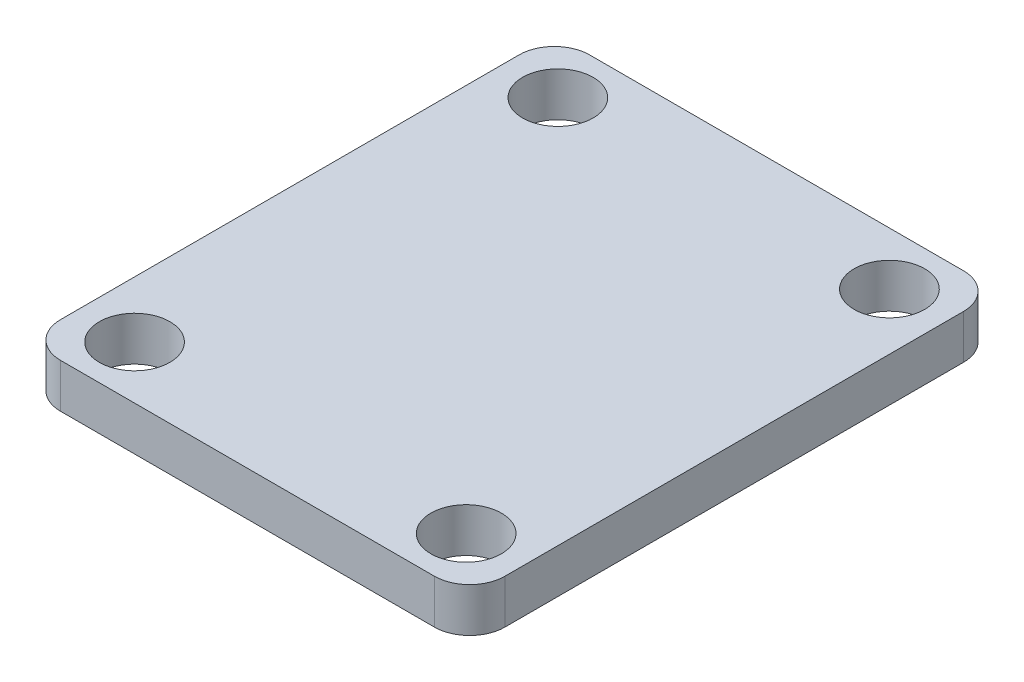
ISO-10303-21;
HEADER;
FILE_DESCRIPTION(('STEP AP214'),'2;1');
FILE_NAME('part.step','',(''),(''),'','','');
FILE_SCHEMA(('AUTOMOTIVE_DESIGN { 1 0 10303 214 1 1 1 1 }'));
ENDSEC;
DATA;
#1=APPLICATION_CONTEXT('core data for automotive mechanical design processes');
#2=APPLICATION_PROTOCOL_DEFINITION('international standard','automotive_design',2000,#1);
#3=PRODUCT_CONTEXT('',#1,'mechanical');
#4=PRODUCT('Part','Part','',(#3));
#5=PRODUCT_RELATED_PRODUCT_CATEGORY('part','',(#4));
#6=PRODUCT_DEFINITION_FORMATION('','',#4);
#7=PRODUCT_DEFINITION_CONTEXT('part definition',#1,'design');
#8=PRODUCT_DEFINITION('design','',#6,#7);
#9=PRODUCT_DEFINITION_SHAPE('','',#8);
#10=(LENGTH_UNIT() NAMED_UNIT(*) SI_UNIT(.MILLI.,.METRE.));
#11=(NAMED_UNIT(*) PLANE_ANGLE_UNIT() SI_UNIT($,.RADIAN.));
#12=(NAMED_UNIT(*) SI_UNIT($,.STERADIAN.) SOLID_ANGLE_UNIT());
#13=UNCERTAINTY_MEASURE_WITH_UNIT(LENGTH_MEASURE(1.E-05),#10,'distance_accuracy_value','');
#14=(GEOMETRIC_REPRESENTATION_CONTEXT(3) GLOBAL_UNCERTAINTY_ASSIGNED_CONTEXT((#13)) GLOBAL_UNIT_ASSIGNED_CONTEXT((#10,
#11,#12)) REPRESENTATION_CONTEXT('',''));
#15=CARTESIAN_POINT('',(0.,0.,0.));
#16=DIRECTION('',(0.,0.,1.));
#17=DIRECTION('',(1.,0.,0.));
#18=AXIS2_PLACEMENT_3D('',#15,#16,#17);
#19=CARTESIAN_POINT('',(-16.002,-3.175,19.05));
#20=DIRECTION('',(-1.,0.,0.));
#21=DIRECTION('',(0.,0.,1.));
#22=AXIS2_PLACEMENT_3D('',#19,#20,#21);
#23=PLANE('',#22);
#24=DIRECTION('',(0.,0.,1.));
#25=VECTOR('',#24,1.);
#26=CARTESIAN_POINT('',(-16.002,-3.175,19.05));
#27=LINE('',#26,#25);
#28=CARTESIAN_POINT('',(-16.002,-3.175,-16.51));
#29=VERTEX_POINT('',#28);
#30=CARTESIAN_POINT('',(-16.002,-3.175,16.51));
#31=VERTEX_POINT('',#30);
#32=EDGE_CURVE('E169',#29,#31,#27,.T.);
#33=ORIENTED_EDGE('',*,*,#32,.T.);
#34=DIRECTION('',(0.,1.,0.));
#35=VECTOR('',#34,1.);
#36=CARTESIAN_POINT('',(-16.002,-3.175,16.51));
#37=LINE('',#36,#35);
#38=CARTESIAN_POINT('',(-16.002,0.,16.51));
#39=VERTEX_POINT('',#38);
#40=EDGE_CURVE('E123',#31,#39,#37,.T.);
#41=ORIENTED_EDGE('',*,*,#40,.T.);
#42=DIRECTION('',(0.,0.,1.));
#43=VECTOR('',#42,1.);
#44=CARTESIAN_POINT('',(-16.002,0.,19.05));
#45=LINE('',#44,#43);
#46=CARTESIAN_POINT('',(-16.002,0.,-16.51));
#47=VERTEX_POINT('',#46);
#48=EDGE_CURVE('E107',#47,#39,#45,.T.);
#49=ORIENTED_EDGE('',*,*,#48,.F.);
#50=DIRECTION('',(0.,1.,0.));
#51=VECTOR('',#50,1.);
#52=CARTESIAN_POINT('',(-16.002,-3.175,-16.51));
#53=LINE('',#52,#51);
#54=EDGE_CURVE('E120',#47,#29,#53,.F.);
#55=ORIENTED_EDGE('',*,*,#54,.T.);
#56=EDGE_LOOP('',(#33,#41,#49,#55));
#57=FACE_BOUND('',#56,.T.);
#58=ADVANCED_FACE('F38',(#57),#23,.T.);
#59=CARTESIAN_POINT('',(16.002,-3.175,-19.05));
#60=DIRECTION('',(0.,0.,-1.));
#61=DIRECTION('',(-1.,0.,0.));
#62=AXIS2_PLACEMENT_3D('',#59,#60,#61);
#63=PLANE('',#62);
#64=DIRECTION('',(-1.,0.,0.));
#65=VECTOR('',#64,1.);
#66=CARTESIAN_POINT('',(16.002,-3.175,-19.05));
#67=LINE('',#66,#65);
#68=CARTESIAN_POINT('',(13.462,-3.175,-19.05));
#69=VERTEX_POINT('',#68);
#70=CARTESIAN_POINT('',(-13.462,-3.175,-19.05));
#71=VERTEX_POINT('',#70);
#72=EDGE_CURVE('E130',#69,#71,#67,.T.);
#73=ORIENTED_EDGE('',*,*,#72,.T.);
#74=DIRECTION('',(0.,1.,0.));
#75=VECTOR('',#74,1.);
#76=CARTESIAN_POINT('',(-13.462,-3.175,-19.05));
#77=LINE('',#76,#75);
#78=CARTESIAN_POINT('',(-13.462,0.,-19.05));
#79=VERTEX_POINT('',#78);
#80=EDGE_CURVE('E156',#71,#79,#77,.T.);
#81=ORIENTED_EDGE('',*,*,#80,.T.);
#82=DIRECTION('',(-1.,0.,0.));
#83=VECTOR('',#82,1.);
#84=CARTESIAN_POINT('',(16.002,0.,-19.05));
#85=LINE('',#84,#83);
#86=CARTESIAN_POINT('',(13.462,0.,-19.05));
#87=VERTEX_POINT('',#86);
#88=EDGE_CURVE('E109',#87,#79,#85,.T.);
#89=ORIENTED_EDGE('',*,*,#88,.F.);
#90=DIRECTION('',(0.,1.,0.));
#91=VECTOR('',#90,1.);
#92=CARTESIAN_POINT('',(13.462,-3.175,-19.05));
#93=LINE('',#92,#91);
#94=EDGE_CURVE('E154',#87,#69,#93,.F.);
#95=ORIENTED_EDGE('',*,*,#94,.T.);
#96=EDGE_LOOP('',(#73,#81,#89,#95));
#97=FACE_BOUND('',#96,.T.);
#98=ADVANCED_FACE('F158',(#97),#63,.T.);
#99=CARTESIAN_POINT('',(16.002,-3.175,19.05));
#100=DIRECTION('',(1.,0.,0.));
#101=DIRECTION('',(0.,0.,-1.));
#102=AXIS2_PLACEMENT_3D('',#99,#100,#101);
#103=PLANE('',#102);
#104=DIRECTION('',(0.,0.,-1.));
#105=VECTOR('',#104,1.);
#106=CARTESIAN_POINT('',(16.002,-3.175,19.05));
#107=LINE('',#106,#105);
#108=CARTESIAN_POINT('',(16.002,-3.175,16.51));
#109=VERTEX_POINT('',#108);
#110=CARTESIAN_POINT('',(16.002,-3.175,-16.51));
#111=VERTEX_POINT('',#110);
#112=EDGE_CURVE('E135',#109,#111,#107,.T.);
#113=ORIENTED_EDGE('',*,*,#112,.T.);
#114=DIRECTION('',(0.,1.,0.));
#115=VECTOR('',#114,1.);
#116=CARTESIAN_POINT('',(16.002,-3.175,-16.51));
#117=LINE('',#116,#115);
#118=CARTESIAN_POINT('',(16.002,0.,-16.51));
#119=VERTEX_POINT('',#118);
#120=EDGE_CURVE('E11',#111,#119,#117,.T.);
#121=ORIENTED_EDGE('',*,*,#120,.T.);
#122=DIRECTION('',(0.,0.,-1.));
#123=VECTOR('',#122,1.);
#124=CARTESIAN_POINT('',(16.002,0.,19.05));
#125=LINE('',#124,#123);
#126=CARTESIAN_POINT('',(16.002,0.,16.51));
#127=VERTEX_POINT('',#126);
#128=EDGE_CURVE('E167',#127,#119,#125,.T.);
#129=ORIENTED_EDGE('',*,*,#128,.F.);
#130=DIRECTION('',(0.,1.,0.));
#131=VECTOR('',#130,1.);
#132=CARTESIAN_POINT('',(16.002,-3.175,16.51));
#133=LINE('',#132,#131);
#134=EDGE_CURVE('E46',#127,#109,#133,.F.);
#135=ORIENTED_EDGE('',*,*,#134,.T.);
#136=EDGE_LOOP('',(#113,#121,#129,#135));
#137=FACE_BOUND('',#136,.T.);
#138=ADVANCED_FACE('F166',(#137),#103,.T.);
#139=CARTESIAN_POINT('',(16.002,-3.175,19.05));
#140=DIRECTION('',(0.,0.,1.));
#141=DIRECTION('',(1.,0.,0.));
#142=AXIS2_PLACEMENT_3D('',#139,#140,#141);
#143=PLANE('',#142);
#144=DIRECTION('',(1.,0.,0.));
#145=VECTOR('',#144,1.);
#146=CARTESIAN_POINT('',(16.002,0.,19.05));
#147=LINE('',#146,#145);
#148=CARTESIAN_POINT('',(-13.462,0.,19.05));
#149=VERTEX_POINT('',#148);
#150=CARTESIAN_POINT('',(13.462,0.,19.05));
#151=VERTEX_POINT('',#150);
#152=EDGE_CURVE('E124',#149,#151,#147,.T.);
#153=ORIENTED_EDGE('',*,*,#152,.F.);
#154=DIRECTION('',(0.,1.,0.));
#155=VECTOR('',#154,1.);
#156=CARTESIAN_POINT('',(-13.462,-3.175,19.05));
#157=LINE('',#156,#155);
#158=CARTESIAN_POINT('',(-13.462,-3.175,19.05));
#159=VERTEX_POINT('',#158);
#160=EDGE_CURVE('E146',#149,#159,#157,.F.);
#161=ORIENTED_EDGE('',*,*,#160,.T.);
#162=DIRECTION('',(1.,0.,0.));
#163=VECTOR('',#162,1.);
#164=CARTESIAN_POINT('',(16.002,-3.175,19.05));
#165=LINE('',#164,#163);
#166=CARTESIAN_POINT('',(13.462,-3.175,19.05));
#167=VERTEX_POINT('',#166);
#168=EDGE_CURVE('E173',#159,#167,#165,.T.);
#169=ORIENTED_EDGE('',*,*,#168,.T.);
#170=DIRECTION('',(0.,1.,0.));
#171=VECTOR('',#170,1.);
#172=CARTESIAN_POINT('',(13.462,-3.175,19.05));
#173=LINE('',#172,#171);
#174=EDGE_CURVE('E143',#167,#151,#173,.T.);
#175=ORIENTED_EDGE('',*,*,#174,.T.);
#176=EDGE_LOOP('',(#153,#161,#169,#175));
#177=FACE_BOUND('',#176,.T.);
#178=ADVANCED_FACE('F235',(#177),#143,.T.);
#179=CARTESIAN_POINT('',(0.,-3.175,0.));
#180=DIRECTION('',(0.,1.,0.));
#181=DIRECTION('',(0.,0.,1.));
#182=AXIS2_PLACEMENT_3D('',#179,#180,#181);
#183=PLANE('',#182);
#184=CARTESIAN_POINT('',(11.938,-3.175,15.24));
#185=DIRECTION('',(0.,1.,0.));
#186=DIRECTION('',(0.,0.,1.));
#187=AXIS2_PLACEMENT_3D('',#184,#185,#186);
#188=CIRCLE('',#187,2.54);
#189=CARTESIAN_POINT('',(11.938,-3.175,17.78));
#190=VERTEX_POINT('',#189);
#191=EDGE_CURVE('E186',#190,#190,#188,.T.);
#192=ORIENTED_EDGE('',*,*,#191,.T.);
#193=EDGE_LOOP('',(#192));
#194=FACE_BOUND('',#193,.T.);
#195=CARTESIAN_POINT('',(-11.938,-3.175,15.24));
#196=DIRECTION('',(0.,1.,0.));
#197=DIRECTION('',(0.,0.,1.));
#198=AXIS2_PLACEMENT_3D('',#195,#196,#197);
#199=CIRCLE('',#198,2.54);
#200=CARTESIAN_POINT('',(-11.938,-3.175,17.78));
#201=VERTEX_POINT('',#200);
#202=EDGE_CURVE('E192',#201,#201,#199,.T.);
#203=ORIENTED_EDGE('',*,*,#202,.T.);
#204=EDGE_LOOP('',(#203));
#205=FACE_BOUND('',#204,.T.);
#206=CARTESIAN_POINT('',(-11.938,-3.175,-15.24));
#207=DIRECTION('',(0.,1.,0.));
#208=DIRECTION('',(0.,0.,1.));
#209=AXIS2_PLACEMENT_3D('',#206,#207,#208);
#210=CIRCLE('',#209,2.54);
#211=CARTESIAN_POINT('',(-11.938,-3.175,-12.7));
#212=VERTEX_POINT('',#211);
#213=EDGE_CURVE('E180',#212,#212,#210,.T.);
#214=ORIENTED_EDGE('',*,*,#213,.T.);
#215=EDGE_LOOP('',(#214));
#216=FACE_BOUND('',#215,.T.);
#217=CARTESIAN_POINT('',(11.938,-3.175,-15.24));
#218=DIRECTION('',(0.,1.,0.));
#219=DIRECTION('',(0.,0.,1.));
#220=AXIS2_PLACEMENT_3D('',#217,#218,#219);
#221=CIRCLE('',#220,2.54);
#222=CARTESIAN_POINT('',(11.938,-3.175,-12.7));
#223=VERTEX_POINT('',#222);
#224=EDGE_CURVE('E125',#223,#223,#221,.T.);
#225=ORIENTED_EDGE('',*,*,#224,.T.);
#226=EDGE_LOOP('',(#225));
#227=FACE_BOUND('',#226,.T.);
#228=ORIENTED_EDGE('',*,*,#168,.F.);
#229=CARTESIAN_POINT('',(-13.462,-3.175,16.51));
#230=DIRECTION('',(0.,1.,0.));
#231=DIRECTION('',(0.,0.,1.));
#232=AXIS2_PLACEMENT_3D('',#229,#230,#231);
#233=CIRCLE('',#232,2.54);
#234=EDGE_CURVE('E152',#159,#31,#233,.F.);
#235=ORIENTED_EDGE('',*,*,#234,.T.);
#236=ORIENTED_EDGE('',*,*,#32,.F.);
#237=CARTESIAN_POINT('',(-13.462,-3.175,-16.51));
#238=DIRECTION('',(0.,1.,0.));
#239=DIRECTION('',(0.,0.,1.));
#240=AXIS2_PLACEMENT_3D('',#237,#238,#239);
#241=CIRCLE('',#240,2.54);
#242=EDGE_CURVE('E129',#29,#71,#241,.F.);
#243=ORIENTED_EDGE('',*,*,#242,.T.);
#244=ORIENTED_EDGE('',*,*,#72,.F.);
#245=CARTESIAN_POINT('',(13.462,-3.175,-16.51));
#246=DIRECTION('',(0.,1.,0.));
#247=DIRECTION('',(0.,0.,1.));
#248=AXIS2_PLACEMENT_3D('',#245,#246,#247);
#249=CIRCLE('',#248,2.54);
#250=EDGE_CURVE('E53',#69,#111,#249,.F.);
#251=ORIENTED_EDGE('',*,*,#250,.T.);
#252=ORIENTED_EDGE('',*,*,#112,.F.);
#253=CARTESIAN_POINT('',(13.462,-3.175,16.51));
#254=DIRECTION('',(0.,1.,0.));
#255=DIRECTION('',(0.,0.,1.));
#256=AXIS2_PLACEMENT_3D('',#253,#254,#255);
#257=CIRCLE('',#256,2.54);
#258=EDGE_CURVE('E148',#109,#167,#257,.F.);
#259=ORIENTED_EDGE('',*,*,#258,.T.);
#260=EDGE_LOOP('',(#228,#235,#236,#243,#244,#251,#252,#259));
#261=FACE_BOUND('',#260,.T.);
#262=ADVANCED_FACE('F161',(#194,#205,#216,#227,#261),#183,.F.);
#263=CARTESIAN_POINT('',(0.,0.,0.));
#264=DIRECTION('',(0.,1.,0.));
#265=DIRECTION('',(0.,0.,1.));
#266=AXIS2_PLACEMENT_3D('',#263,#264,#265);
#267=PLANE('',#266);
#268=CARTESIAN_POINT('',(11.938,0.,15.24));
#269=DIRECTION('',(0.,1.,0.));
#270=DIRECTION('',(0.,0.,1.));
#271=AXIS2_PLACEMENT_3D('',#268,#269,#270);
#272=CIRCLE('',#271,2.54);
#273=CARTESIAN_POINT('',(11.938,0.,17.78));
#274=VERTEX_POINT('',#273);
#275=EDGE_CURVE('E183',#274,#274,#272,.T.);
#276=ORIENTED_EDGE('',*,*,#275,.F.);
#277=EDGE_LOOP('',(#276));
#278=FACE_BOUND('',#277,.T.);
#279=CARTESIAN_POINT('',(-11.938,0.,15.24));
#280=DIRECTION('',(0.,1.,0.));
#281=DIRECTION('',(0.,0.,1.));
#282=AXIS2_PLACEMENT_3D('',#279,#280,#281);
#283=CIRCLE('',#282,2.54);
#284=CARTESIAN_POINT('',(-11.938,0.,17.78));
#285=VERTEX_POINT('',#284);
#286=EDGE_CURVE('E189',#285,#285,#283,.T.);
#287=ORIENTED_EDGE('',*,*,#286,.F.);
#288=EDGE_LOOP('',(#287));
#289=FACE_BOUND('',#288,.T.);
#290=CARTESIAN_POINT('',(-11.938,0.,-15.24));
#291=DIRECTION('',(0.,1.,0.));
#292=DIRECTION('',(0.,0.,1.));
#293=AXIS2_PLACEMENT_3D('',#290,#291,#292);
#294=CIRCLE('',#293,2.54);
#295=CARTESIAN_POINT('',(-11.938,0.,-12.7));
#296=VERTEX_POINT('',#295);
#297=EDGE_CURVE('E195',#296,#296,#294,.T.);
#298=ORIENTED_EDGE('',*,*,#297,.F.);
#299=EDGE_LOOP('',(#298));
#300=FACE_BOUND('',#299,.T.);
#301=CARTESIAN_POINT('',(11.938,0.,-15.24));
#302=DIRECTION('',(0.,1.,0.));
#303=DIRECTION('',(0.,0.,1.));
#304=AXIS2_PLACEMENT_3D('',#301,#302,#303);
#305=CIRCLE('',#304,2.54);
#306=CARTESIAN_POINT('',(11.938,0.,-12.7));
#307=VERTEX_POINT('',#306);
#308=EDGE_CURVE('E177',#307,#307,#305,.T.);
#309=ORIENTED_EDGE('',*,*,#308,.F.);
#310=EDGE_LOOP('',(#309));
#311=FACE_BOUND('',#310,.T.);
#312=ORIENTED_EDGE('',*,*,#48,.T.);
#313=CARTESIAN_POINT('',(-13.462,0.,16.51));
#314=DIRECTION('',(0.,1.,0.));
#315=DIRECTION('',(0.,0.,1.));
#316=AXIS2_PLACEMENT_3D('',#313,#314,#315);
#317=CIRCLE('',#316,2.54);
#318=EDGE_CURVE('E114',#39,#149,#317,.T.);
#319=ORIENTED_EDGE('',*,*,#318,.T.);
#320=ORIENTED_EDGE('',*,*,#152,.T.);
#321=CARTESIAN_POINT('',(13.462,0.,16.51));
#322=DIRECTION('',(0.,1.,0.));
#323=DIRECTION('',(0.,0.,1.));
#324=AXIS2_PLACEMENT_3D('',#321,#322,#323);
#325=CIRCLE('',#324,2.54);
#326=EDGE_CURVE('E132',#151,#127,#325,.T.);
#327=ORIENTED_EDGE('',*,*,#326,.T.);
#328=ORIENTED_EDGE('',*,*,#128,.T.);
#329=CARTESIAN_POINT('',(13.462,0.,-16.51));
#330=DIRECTION('',(0.,1.,0.));
#331=DIRECTION('',(0.,0.,1.));
#332=AXIS2_PLACEMENT_3D('',#329,#330,#331);
#333=CIRCLE('',#332,2.54);
#334=EDGE_CURVE('E115',#119,#87,#333,.T.);
#335=ORIENTED_EDGE('',*,*,#334,.T.);
#336=ORIENTED_EDGE('',*,*,#88,.T.);
#337=CARTESIAN_POINT('',(-13.462,0.,-16.51));
#338=DIRECTION('',(0.,1.,0.));
#339=DIRECTION('',(0.,0.,1.));
#340=AXIS2_PLACEMENT_3D('',#337,#338,#339);
#341=CIRCLE('',#340,2.54);
#342=EDGE_CURVE('E104',#79,#47,#341,.T.);
#343=ORIENTED_EDGE('',*,*,#342,.T.);
#344=EDGE_LOOP('',(#312,#319,#320,#327,#328,#335,#336,#343));
#345=FACE_BOUND('',#344,.T.);
#346=ADVANCED_FACE('F106',(#278,#289,#300,#311,#345),#267,.T.);
#347=CARTESIAN_POINT('',(11.938,-3.175,-15.24));
#348=DIRECTION('',(0.,1.,0.));
#349=DIRECTION('',(0.,0.,1.));
#350=AXIS2_PLACEMENT_3D('',#347,#348,#349);
#351=CYLINDRICAL_SURFACE('',#350,2.54);
#352=ORIENTED_EDGE('',*,*,#224,.F.);
#353=EDGE_LOOP('',(#352));
#354=FACE_BOUND('',#353,.T.);
#355=ORIENTED_EDGE('',*,*,#308,.T.);
#356=EDGE_LOOP('',(#355));
#357=FACE_BOUND('',#356,.T.);
#358=ADVANCED_FACE('F207',(#354,#357),#351,.F.);
#359=CARTESIAN_POINT('',(-11.938,-3.175,-15.24));
#360=DIRECTION('',(0.,1.,0.));
#361=DIRECTION('',(0.,0.,1.));
#362=AXIS2_PLACEMENT_3D('',#359,#360,#361);
#363=CYLINDRICAL_SURFACE('',#362,2.54);
#364=ORIENTED_EDGE('',*,*,#213,.F.);
#365=EDGE_LOOP('',(#364));
#366=FACE_BOUND('',#365,.T.);
#367=ORIENTED_EDGE('',*,*,#297,.T.);
#368=EDGE_LOOP('',(#367));
#369=FACE_BOUND('',#368,.T.);
#370=ADVANCED_FACE('F203',(#366,#369),#363,.F.);
#371=CARTESIAN_POINT('',(-11.938,-3.175,15.24));
#372=DIRECTION('',(0.,1.,0.));
#373=DIRECTION('',(0.,0.,1.));
#374=AXIS2_PLACEMENT_3D('',#371,#372,#373);
#375=CYLINDRICAL_SURFACE('',#374,2.54);
#376=ORIENTED_EDGE('',*,*,#202,.F.);
#377=EDGE_LOOP('',(#376));
#378=FACE_BOUND('',#377,.T.);
#379=ORIENTED_EDGE('',*,*,#286,.T.);
#380=EDGE_LOOP('',(#379));
#381=FACE_BOUND('',#380,.T.);
#382=ADVANCED_FACE('F206',(#378,#381),#375,.F.);
#383=CARTESIAN_POINT('',(11.938,-3.175,15.24));
#384=DIRECTION('',(0.,1.,0.));
#385=DIRECTION('',(0.,0.,1.));
#386=AXIS2_PLACEMENT_3D('',#383,#384,#385);
#387=CYLINDRICAL_SURFACE('',#386,2.54);
#388=ORIENTED_EDGE('',*,*,#191,.F.);
#389=EDGE_LOOP('',(#388));
#390=FACE_BOUND('',#389,.T.);
#391=ORIENTED_EDGE('',*,*,#275,.T.);
#392=EDGE_LOOP('',(#391));
#393=FACE_BOUND('',#392,.T.);
#394=ADVANCED_FACE('F240',(#390,#393),#387,.F.);
#395=CARTESIAN_POINT('',(-13.462,-3.175,16.51));
#396=DIRECTION('',(0.,1.,0.));
#397=DIRECTION('',(0.,0.,1.));
#398=AXIS2_PLACEMENT_3D('',#395,#396,#397);
#399=CYLINDRICAL_SURFACE('',#398,2.54);
#400=ORIENTED_EDGE('',*,*,#234,.F.);
#401=ORIENTED_EDGE('',*,*,#160,.F.);
#402=ORIENTED_EDGE('',*,*,#318,.F.);
#403=ORIENTED_EDGE('',*,*,#40,.F.);
#404=EDGE_LOOP('',(#400,#401,#402,#403));
#405=FACE_BOUND('',#404,.T.);
#406=ADVANCED_FACE('F237',(#405),#399,.T.);
#407=CARTESIAN_POINT('',(-13.462,-3.175,-16.51));
#408=DIRECTION('',(0.,1.,0.));
#409=DIRECTION('',(0.,0.,1.));
#410=AXIS2_PLACEMENT_3D('',#407,#408,#409);
#411=CYLINDRICAL_SURFACE('',#410,2.54);
#412=ORIENTED_EDGE('',*,*,#242,.F.);
#413=ORIENTED_EDGE('',*,*,#54,.F.);
#414=ORIENTED_EDGE('',*,*,#342,.F.);
#415=ORIENTED_EDGE('',*,*,#80,.F.);
#416=EDGE_LOOP('',(#412,#413,#414,#415));
#417=FACE_BOUND('',#416,.T.);
#418=ADVANCED_FACE('F128',(#417),#411,.T.);
#419=CARTESIAN_POINT('',(13.462,-3.175,-16.51));
#420=DIRECTION('',(0.,1.,0.));
#421=DIRECTION('',(0.,0.,1.));
#422=AXIS2_PLACEMENT_3D('',#419,#420,#421);
#423=CYLINDRICAL_SURFACE('',#422,2.54);
#424=ORIENTED_EDGE('',*,*,#250,.F.);
#425=ORIENTED_EDGE('',*,*,#94,.F.);
#426=ORIENTED_EDGE('',*,*,#334,.F.);
#427=ORIENTED_EDGE('',*,*,#120,.F.);
#428=EDGE_LOOP('',(#424,#425,#426,#427));
#429=FACE_BOUND('',#428,.T.);
#430=ADVANCED_FACE('F164',(#429),#423,.T.);
#431=CARTESIAN_POINT('',(13.462,-3.175,16.51));
#432=DIRECTION('',(0.,1.,0.));
#433=DIRECTION('',(0.,0.,1.));
#434=AXIS2_PLACEMENT_3D('',#431,#432,#433);
#435=CYLINDRICAL_SURFACE('',#434,2.54);
#436=ORIENTED_EDGE('',*,*,#258,.F.);
#437=ORIENTED_EDGE('',*,*,#134,.F.);
#438=ORIENTED_EDGE('',*,*,#326,.F.);
#439=ORIENTED_EDGE('',*,*,#174,.F.);
#440=EDGE_LOOP('',(#436,#437,#438,#439));
#441=FACE_BOUND('',#440,.T.);
#442=ADVANCED_FACE('F40',(#441),#435,.T.);
#443=CLOSED_SHELL('',(#58,#98,#138,#178,#262,#346,#358,#370,#382,#394,#406,#418,#430,#442));
#444=MANIFOLD_SOLID_BREP('B2',#443);
#445=ADVANCED_BREP_SHAPE_REPRESENTATION('',(#18,#444),#14);
#446=SHAPE_DEFINITION_REPRESENTATION(#9,#445);
ENDSEC;
END-ISO-10303-21;
